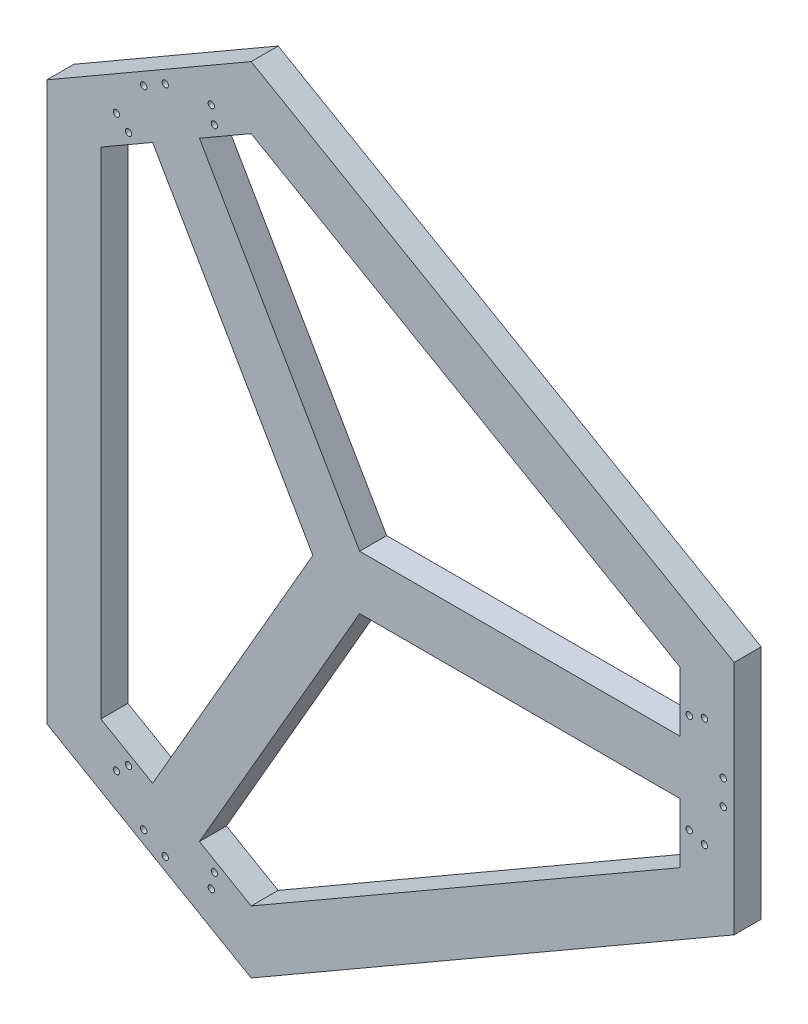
ISO-10303-21;
HEADER;
FILE_DESCRIPTION(('STEP AP214'),'2;1');
FILE_NAME('part.step','',(''),(''),'','','');
FILE_SCHEMA(('AUTOMOTIVE_DESIGN { 1 0 10303 214 1 1 1 1 }'));
ENDSEC;
DATA;
#1=APPLICATION_CONTEXT('core data for automotive mechanical design processes');
#2=APPLICATION_PROTOCOL_DEFINITION('international standard','automotive_design',2000,#1);
#3=PRODUCT_CONTEXT('',#1,'mechanical');
#4=PRODUCT('Part','Part','',(#3));
#5=PRODUCT_RELATED_PRODUCT_CATEGORY('part','',(#4));
#6=PRODUCT_DEFINITION_FORMATION('','',#4);
#7=PRODUCT_DEFINITION_CONTEXT('part definition',#1,'design');
#8=PRODUCT_DEFINITION('design','',#6,#7);
#9=PRODUCT_DEFINITION_SHAPE('','',#8);
#10=(LENGTH_UNIT() NAMED_UNIT(*) SI_UNIT(.MILLI.,.METRE.));
#11=(NAMED_UNIT(*) PLANE_ANGLE_UNIT() SI_UNIT($,.RADIAN.));
#12=(NAMED_UNIT(*) SI_UNIT($,.STERADIAN.) SOLID_ANGLE_UNIT());
#13=UNCERTAINTY_MEASURE_WITH_UNIT(LENGTH_MEASURE(1.E-05),#10,'distance_accuracy_value','');
#14=(GEOMETRIC_REPRESENTATION_CONTEXT(3) GLOBAL_UNCERTAINTY_ASSIGNED_CONTEXT((#13)) GLOBAL_UNIT_ASSIGNED_CONTEXT((#10,
#11,#12)) REPRESENTATION_CONTEXT('',''));
#15=CARTESIAN_POINT('',(0.,0.,0.));
#16=DIRECTION('',(0.,0.,1.));
#17=DIRECTION('',(1.,0.,0.));
#18=AXIS2_PLACEMENT_3D('',#15,#16,#17);
#19=CARTESIAN_POINT('',(-228.670702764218,232.862278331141,25.4));
#20=DIRECTION('',(0.5,-0.866025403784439,0.));
#21=DIRECTION('',(0.866025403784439,0.5,0.));
#22=AXIS2_PLACEMENT_3D('',#19,#20,#21);
#23=PLANE('',#22);
#24=DIRECTION('',(0.,0.,1.));
#25=VECTOR('',#24,1.);
#26=CARTESIAN_POINT('',(-179.997045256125,260.964027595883,0.));
#27=LINE('',#26,#25);
#28=CARTESIAN_POINT('',(-179.997045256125,260.964027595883,0.));
#29=VERTEX_POINT('',#28);
#30=CARTESIAN_POINT('',(-179.997045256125,260.964027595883,25.4));
#31=VERTEX_POINT('',#30);
#32=EDGE_CURVE('E252',#29,#31,#27,.T.);
#33=ORIENTED_EDGE('',*,*,#32,.T.);
#34=DIRECTION('',(-0.866025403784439,-0.5,0.));
#35=VECTOR('',#34,1.);
#36=CARTESIAN_POINT('',(-228.670702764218,232.862278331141,25.4));
#37=LINE('',#36,#35);
#38=CARTESIAN_POINT('',(-228.670702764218,232.862278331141,25.4));
#39=VERTEX_POINT('',#38);
#40=EDGE_CURVE('E366',#31,#39,#37,.T.);
#41=ORIENTED_EDGE('',*,*,#40,.T.);
#42=DIRECTION('',(0.,0.,-1.));
#43=VECTOR('',#42,1.);
#44=CARTESIAN_POINT('',(-228.670702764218,232.862278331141,25.4));
#45=LINE('',#44,#43);
#46=CARTESIAN_POINT('',(-228.670702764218,232.862278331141,0.));
#47=VERTEX_POINT('',#46);
#48=EDGE_CURVE('E405',#39,#47,#45,.T.);
#49=ORIENTED_EDGE('',*,*,#48,.T.);
#50=DIRECTION('',(-0.866025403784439,-0.5,0.));
#51=VECTOR('',#50,1.);
#52=CARTESIAN_POINT('',(-228.670702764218,232.862278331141,0.));
#53=LINE('',#52,#51);
#54=EDGE_CURVE('E62',#29,#47,#53,.T.);
#55=ORIENTED_EDGE('',*,*,#54,.F.);
#56=EDGE_LOOP('',(#33,#41,#49,#55));
#57=FACE_BOUND('',#56,.T.);
#58=ADVANCED_FACE('F39',(#57),#23,.T.);
#59=CARTESIAN_POINT('',(-87.329297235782,-314.465776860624,25.4));
#60=DIRECTION('',(0.5,0.866025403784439,0.));
#61=DIRECTION('',(-0.866025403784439,0.5,0.));
#62=AXIS2_PLACEMENT_3D('',#59,#60,#61);
#63=PLANE('',#62);
#64=DIRECTION('',(0.,0.,1.));
#65=VECTOR('',#64,1.);
#66=CARTESIAN_POINT('',(-136.002954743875,-286.364027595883,0.));
#67=LINE('',#66,#65);
#68=CARTESIAN_POINT('',(-136.002954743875,-286.364027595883,0.));
#69=VERTEX_POINT('',#68);
#70=CARTESIAN_POINT('',(-136.002954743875,-286.364027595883,25.4));
#71=VERTEX_POINT('',#70);
#72=EDGE_CURVE('E244',#69,#71,#67,.T.);
#73=ORIENTED_EDGE('',*,*,#72,.T.);
#74=DIRECTION('',(0.866025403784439,-0.5,0.));
#75=VECTOR('',#74,1.);
#76=CARTESIAN_POINT('',(-87.329297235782,-314.465776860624,25.4));
#77=LINE('',#76,#75);
#78=CARTESIAN_POINT('',(-87.329297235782,-314.465776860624,25.4));
#79=VERTEX_POINT('',#78);
#80=EDGE_CURVE('E371',#71,#79,#77,.T.);
#81=ORIENTED_EDGE('',*,*,#80,.T.);
#82=DIRECTION('',(0.,0.,-1.));
#83=VECTOR('',#82,1.);
#84=CARTESIAN_POINT('',(-87.329297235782,-314.465776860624,25.4));
#85=LINE('',#84,#83);
#86=CARTESIAN_POINT('',(-87.329297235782,-314.465776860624,0.));
#87=VERTEX_POINT('',#86);
#88=EDGE_CURVE('E400',#79,#87,#85,.T.);
#89=ORIENTED_EDGE('',*,*,#88,.T.);
#90=DIRECTION('',(0.866025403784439,-0.5,0.));
#91=VECTOR('',#90,1.);
#92=CARTESIAN_POINT('',(-87.329297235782,-314.465776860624,0.));
#93=LINE('',#92,#91);
#94=EDGE_CURVE('E386',#69,#87,#93,.T.);
#95=ORIENTED_EDGE('',*,*,#94,.F.);
#96=EDGE_LOOP('',(#73,#81,#89,#95));
#97=FACE_BOUND('',#96,.T.);
#98=ADVANCED_FACE('F492',(#97),#63,.T.);
#99=CARTESIAN_POINT('',(316.,81.6034985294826,25.4));
#100=DIRECTION('',(-1.,0.,0.));
#101=DIRECTION('',(0.,0.,1.));
#102=AXIS2_PLACEMENT_3D('',#99,#100,#101);
#103=PLANE('',#102);
#104=DIRECTION('',(0.,0.,1.));
#105=VECTOR('',#104,1.);
#106=CARTESIAN_POINT('',(316.,-25.4,0.));
#107=LINE('',#106,#105);
#108=CARTESIAN_POINT('',(316.,-25.4,0.));
#109=VERTEX_POINT('',#108);
#110=CARTESIAN_POINT('',(316.,-25.4,25.4));
#111=VERTEX_POINT('',#110);
#112=EDGE_CURVE('E238',#109,#111,#107,.T.);
#113=ORIENTED_EDGE('',*,*,#112,.F.);
#114=DIRECTION('',(0.,1.,0.));
#115=VECTOR('',#114,1.);
#116=CARTESIAN_POINT('',(316.,81.6034985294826,0.));
#117=LINE('',#116,#115);
#118=CARTESIAN_POINT('',(316.,-81.6034985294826,0.));
#119=VERTEX_POINT('',#118);
#120=EDGE_CURVE('E367',#119,#109,#117,.T.);
#121=ORIENTED_EDGE('',*,*,#120,.F.);
#122=DIRECTION('',(0.,0.,-1.));
#123=VECTOR('',#122,1.);
#124=CARTESIAN_POINT('',(316.,-81.6034985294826,25.4));
#125=LINE('',#124,#123);
#126=CARTESIAN_POINT('',(316.,-81.6034985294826,25.4));
#127=VERTEX_POINT('',#126);
#128=EDGE_CURVE('E398',#127,#119,#125,.T.);
#129=ORIENTED_EDGE('',*,*,#128,.F.);
#130=DIRECTION('',(0.,1.,0.));
#131=VECTOR('',#130,1.);
#132=CARTESIAN_POINT('',(316.,81.6034985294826,25.4));
#133=LINE('',#132,#131);
#134=EDGE_CURVE('E378',#127,#111,#133,.T.);
#135=ORIENTED_EDGE('',*,*,#134,.T.);
#136=EDGE_LOOP('',(#113,#121,#129,#135));
#137=FACE_BOUND('',#136,.T.);
#138=ADVANCED_FACE('F497',(#137),#103,.T.);
#139=CARTESIAN_POINT('',(0.,0.,25.4));
#140=DIRECTION('',(0.,0.,-1.));
#141=DIRECTION('',(-1.,0.,0.));
#142=AXIS2_PLACEMENT_3D('',#139,#140,#141);
#143=PLANE('',#142);
#144=ORIENTED_EDGE('',*,*,#40,.F.);
#145=DIRECTION('',(0.5,-0.866025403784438,0.));
#146=VECTOR('',#145,1.);
#147=CARTESIAN_POINT('',(-179.997045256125,260.964027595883,25.4));
#148=LINE('',#147,#146);
#149=CARTESIAN_POINT('',(-29.329393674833,0.,25.4));
#150=VERTEX_POINT('',#149);
#151=EDGE_CURVE('E230',#31,#150,#148,.T.);
#152=ORIENTED_EDGE('',*,*,#151,.T.);
#153=DIRECTION('',(-0.5,-0.866025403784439,0.));
#154=VECTOR('',#153,1.);
#155=CARTESIAN_POINT('',(-179.997045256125,-260.964027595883,25.4));
#156=LINE('',#155,#154);
#157=CARTESIAN_POINT('',(-179.997045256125,-260.964027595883,25.4));
#158=VERTEX_POINT('',#157);
#159=EDGE_CURVE('E233',#150,#158,#156,.T.);
#160=ORIENTED_EDGE('',*,*,#159,.T.);
#161=CARTESIAN_POINT('',(-228.670702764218,-232.862278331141,25.4));
#162=VERTEX_POINT('',#161);
#163=EDGE_CURVE('E372',#162,#158,#77,.T.);
#164=ORIENTED_EDGE('',*,*,#163,.F.);
#165=DIRECTION('',(0.,-1.,0.));
#166=VECTOR('',#165,1.);
#167=CARTESIAN_POINT('',(-228.670702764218,232.862278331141,25.4));
#168=LINE('',#167,#166);
#169=EDGE_CURVE('E369',#39,#162,#168,.T.);
#170=ORIENTED_EDGE('',*,*,#169,.F.);
#171=EDGE_LOOP('',(#144,#152,#160,#164,#170));
#172=FACE_BOUND('',#171,.T.);
#173=ORIENTED_EDGE('',*,*,#80,.F.);
#174=DIRECTION('',(0.5,0.866025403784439,0.));
#175=VECTOR('',#174,1.);
#176=CARTESIAN_POINT('',(-136.002954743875,-286.364027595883,25.4));
#177=LINE('',#176,#175);
#178=CARTESIAN_POINT('',(14.6646968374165,-25.4000000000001,25.4));
#179=VERTEX_POINT('',#178);
#180=EDGE_CURVE('E213',#71,#179,#177,.T.);
#181=ORIENTED_EDGE('',*,*,#180,.T.);
#182=DIRECTION('',(1.,0.,0.));
#183=VECTOR('',#182,1.);
#184=CARTESIAN_POINT('',(316.,-25.4,25.4));
#185=LINE('',#184,#183);
#186=EDGE_CURVE('E210',#179,#111,#185,.T.);
#187=ORIENTED_EDGE('',*,*,#186,.T.);
#188=ORIENTED_EDGE('',*,*,#134,.F.);
#189=DIRECTION('',(0.866025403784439,0.5,0.));
#190=VECTOR('',#189,1.);
#191=CARTESIAN_POINT('',(-87.329297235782,-314.465776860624,25.4));
#192=LINE('',#191,#190);
#193=EDGE_CURVE('E374',#79,#127,#192,.T.);
#194=ORIENTED_EDGE('',*,*,#193,.F.);
#195=EDGE_LOOP('',(#173,#181,#187,#188,#194));
#196=FACE_BOUND('',#195,.T.);
#197=DIRECTION('',(-0.866025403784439,-0.5,0.));
#198=VECTOR('',#197,1.);
#199=CARTESIAN_POINT('',(-279.470702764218,262.191672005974,25.4));
#200=LINE('',#199,#198);
#201=CARTESIAN_POINT('',(-87.3292972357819,373.12456421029,25.4));
#202=VERTEX_POINT('',#201);
#203=CARTESIAN_POINT('',(-279.470702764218,262.191672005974,25.4));
#204=VERTEX_POINT('',#203);
#205=EDGE_CURVE('E411',#202,#204,#200,.T.);
#206=ORIENTED_EDGE('',*,*,#205,.T.);
#207=DIRECTION('',(0.,-1.,0.));
#208=VECTOR('',#207,1.);
#209=CARTESIAN_POINT('',(-279.470702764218,262.191672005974,25.4));
#210=LINE('',#209,#208);
#211=CARTESIAN_POINT('',(-279.470702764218,-262.191672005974,25.4));
#212=VERTEX_POINT('',#211);
#213=EDGE_CURVE('E414',#204,#212,#210,.T.);
#214=ORIENTED_EDGE('',*,*,#213,.T.);
#215=DIRECTION('',(0.866025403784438,-0.5,0.));
#216=VECTOR('',#215,1.);
#217=CARTESIAN_POINT('',(-87.329297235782,-373.12456421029,25.4));
#218=LINE('',#217,#216);
#219=CARTESIAN_POINT('',(-87.329297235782,-373.12456421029,25.4));
#220=VERTEX_POINT('',#219);
#221=EDGE_CURVE('E417',#212,#220,#218,.T.);
#222=ORIENTED_EDGE('',*,*,#221,.T.);
#223=DIRECTION('',(0.866025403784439,0.5,0.));
#224=VECTOR('',#223,1.);
#225=CARTESIAN_POINT('',(-87.329297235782,-373.12456421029,25.4));
#226=LINE('',#225,#224);
#227=CARTESIAN_POINT('',(366.8,-110.932892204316,25.4));
#228=VERTEX_POINT('',#227);
#229=EDGE_CURVE('E419',#220,#228,#226,.T.);
#230=ORIENTED_EDGE('',*,*,#229,.T.);
#231=DIRECTION('',(0.,1.,0.));
#232=VECTOR('',#231,1.);
#233=CARTESIAN_POINT('',(366.8,110.932892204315,25.4));
#234=LINE('',#233,#232);
#235=CARTESIAN_POINT('',(366.8,110.932892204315,25.4));
#236=VERTEX_POINT('',#235);
#237=EDGE_CURVE('E421',#228,#236,#234,.T.);
#238=ORIENTED_EDGE('',*,*,#237,.T.);
#239=DIRECTION('',(-0.866025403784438,0.5,0.));
#240=VECTOR('',#239,1.);
#241=CARTESIAN_POINT('',(-87.3292972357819,373.12456421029,25.4));
#242=LINE('',#241,#240);
#243=EDGE_CURVE('E423',#236,#202,#242,.T.);
#244=ORIENTED_EDGE('',*,*,#243,.T.);
#245=EDGE_LOOP('',(#206,#214,#222,#230,#238,#244));
#246=FACE_BOUND('',#245,.T.);
#247=DIRECTION('',(-0.866025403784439,0.5,0.));
#248=VECTOR('',#247,1.);
#249=CARTESIAN_POINT('',(-87.329297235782,314.465776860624,25.4));
#250=LINE('',#249,#248);
#251=CARTESIAN_POINT('',(316.,81.6034985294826,25.4));
#252=VERTEX_POINT('',#251);
#253=CARTESIAN_POINT('',(-87.329297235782,314.465776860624,25.4));
#254=VERTEX_POINT('',#253);
#255=EDGE_CURVE('E364',#252,#254,#250,.T.);
#256=ORIENTED_EDGE('',*,*,#255,.F.);
#257=CARTESIAN_POINT('',(316.,25.4,25.4));
#258=VERTEX_POINT('',#257);
#259=EDGE_CURVE('E377',#258,#252,#133,.T.);
#260=ORIENTED_EDGE('',*,*,#259,.F.);
#261=DIRECTION('',(-1.,0.,0.));
#262=VECTOR('',#261,1.);
#263=CARTESIAN_POINT('',(316.,25.4,25.4));
#264=LINE('',#263,#262);
#265=CARTESIAN_POINT('',(14.6646968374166,25.4,25.4));
#266=VERTEX_POINT('',#265);
#267=EDGE_CURVE('E227',#258,#266,#264,.T.);
#268=ORIENTED_EDGE('',*,*,#267,.T.);
#269=DIRECTION('',(-0.500000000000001,0.866025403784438,0.));
#270=VECTOR('',#269,1.);
#271=CARTESIAN_POINT('',(-136.002954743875,286.364027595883,25.4));
#272=LINE('',#271,#270);
#273=CARTESIAN_POINT('',(-136.002954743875,286.364027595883,25.4));
#274=VERTEX_POINT('',#273);
#275=EDGE_CURVE('E189',#266,#274,#272,.T.);
#276=ORIENTED_EDGE('',*,*,#275,.T.);
#277=EDGE_CURVE('E54',#254,#274,#37,.T.);
#278=ORIENTED_EDGE('',*,*,#277,.F.);
#279=EDGE_LOOP('',(#256,#260,#268,#276,#278));
#280=FACE_BOUND('',#279,.T.);
#281=CARTESIAN_POINT('',(-121.906704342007,-304.371002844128,25.4));
#282=DIRECTION('',(0.,0.,1.));
#283=DIRECTION('',(1.,0.,0.));
#284=AXIS2_PLACEMENT_3D('',#281,#282,#283);
#285=CIRCLE('',#284,3.);
#286=CARTESIAN_POINT('',(-118.906704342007,-304.371002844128,25.4));
#287=VERTEX_POINT('',#286);
#288=EDGE_CURVE('E358',#287,#287,#285,.T.);
#289=ORIENTED_EDGE('',*,*,#288,.F.);
#290=EDGE_LOOP('',(#289));
#291=FACE_BOUND('',#290,.T.);
#292=CARTESIAN_POINT('',(-124.845889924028,-319.202828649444,25.4));
#293=DIRECTION('',(0.,0.,1.));
#294=DIRECTION('',(1.,0.,0.));
#295=AXIS2_PLACEMENT_3D('',#292,#293,#294);
#296=CIRCLE('',#295,2.99999999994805);
#297=CARTESIAN_POINT('',(-121.84588992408,-319.202828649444,25.4));
#298=VERTEX_POINT('',#297);
#299=EDGE_CURVE('E352',#298,#298,#296,.T.);
#300=ORIENTED_EDGE('',*,*,#299,.F.);
#301=EDGE_LOOP('',(#300));
#302=FACE_BOUND('',#301,.T.);
#303=CARTESIAN_POINT('',(-168.16135563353,-314.604883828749,25.4));
#304=DIRECTION('',(0.,0.,1.));
#305=DIRECTION('',(1.,0.,0.));
#306=AXIS2_PLACEMENT_3D('',#303,#304,#305);
#307=CIRCLE('',#306,3.00000000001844);
#308=CARTESIAN_POINT('',(-165.161355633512,-314.604883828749,25.4));
#309=VERTEX_POINT('',#308);
#310=EDGE_CURVE('E346',#309,#309,#307,.T.);
#311=ORIENTED_EDGE('',*,*,#310,.F.);
#312=EDGE_LOOP('',(#311));
#313=FACE_BOUND('',#312,.T.);
#314=CARTESIAN_POINT('',(-188.375143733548,-302.93444782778,25.4));
#315=DIRECTION('',(0.,0.,1.));
#316=DIRECTION('',(1.,0.,0.));
#317=AXIS2_PLACEMENT_3D('',#314,#315,#316);
#318=CIRCLE('',#317,3.00000000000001);
#319=CARTESIAN_POINT('',(-185.375143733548,-302.93444782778,25.4));
#320=VERTEX_POINT('',#319);
#321=EDGE_CURVE('E340',#320,#320,#318,.T.);
#322=ORIENTED_EDGE('',*,*,#321,.F.);
#323=EDGE_LOOP('',(#322));
#324=FACE_BOUND('',#323,.T.);
#325=CARTESIAN_POINT('',(324.546372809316,46.6111985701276,25.4));
#326=DIRECTION('',(0.,0.,1.));
#327=DIRECTION('',(1.,0.,0.));
#328=AXIS2_PLACEMENT_3D('',#325,#326,#327);
#329=CIRCLE('',#328,3.00000000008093);
#330=CARTESIAN_POINT('',(327.546372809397,46.6111985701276,25.4));
#331=VERTEX_POINT('',#330);
#332=EDGE_CURVE('E334',#331,#331,#329,.T.);
#333=ORIENTED_EDGE('',*,*,#332,.F.);
#334=EDGE_LOOP('',(#333));
#335=FACE_BOUND('',#334,.T.);
#336=CARTESIAN_POINT('',(338.860703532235,51.4817020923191,25.4));
#337=DIRECTION('',(0.,0.,1.));
#338=DIRECTION('',(1.,0.,0.));
#339=AXIS2_PLACEMENT_3D('',#336,#337,#338);
#340=CIRCLE('',#339,3.00000000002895);
#341=CARTESIAN_POINT('',(341.860703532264,51.4817020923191,25.4));
#342=VERTEX_POINT('',#341);
#343=EDGE_CURVE('E328',#342,#342,#340,.T.);
#344=ORIENTED_EDGE('',*,*,#343,.F.);
#345=EDGE_LOOP('',(#344));
#346=FACE_BOUND('',#345,.T.);
#347=CARTESIAN_POINT('',(356.536499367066,11.6704360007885,25.4));
#348=DIRECTION('',(0.,0.,1.));
#349=DIRECTION('',(1.,0.,0.));
#350=AXIS2_PLACEMENT_3D('',#347,#348,#349);
#351=CIRCLE('',#350,2.99999999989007);
#352=CARTESIAN_POINT('',(359.536499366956,11.6704360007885,25.4));
#353=VERTEX_POINT('',#352);
#354=EDGE_CURVE('E322',#353,#353,#351,.T.);
#355=ORIENTED_EDGE('',*,*,#354,.F.);
#356=EDGE_LOOP('',(#355));
#357=FACE_BOUND('',#356,.T.);
#358=CARTESIAN_POINT('',(356.536499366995,-11.6704360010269,25.4));
#359=DIRECTION('',(0.,0.,1.));
#360=DIRECTION('',(1.,0.,0.));
#361=AXIS2_PLACEMENT_3D('',#358,#359,#360);
#362=CIRCLE('',#361,2.99999999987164);
#363=CARTESIAN_POINT('',(359.536499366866,-11.6704360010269,25.4));
#364=VERTEX_POINT('',#363);
#365=EDGE_CURVE('E316',#364,#364,#362,.T.);
#366=ORIENTED_EDGE('',*,*,#365,.F.);
#367=EDGE_LOOP('',(#366));
#368=FACE_BOUND('',#367,.T.);
#369=CARTESIAN_POINT('',(324.546372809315,-46.6111985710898,25.4));
#370=DIRECTION('',(0.,0.,1.));
#371=DIRECTION('',(1.,0.,0.));
#372=AXIS2_PLACEMENT_3D('',#369,#370,#371);
#373=CIRCLE('',#372,3.00000000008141);
#374=CARTESIAN_POINT('',(327.546372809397,-46.6111985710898,25.4));
#375=VERTEX_POINT('',#374);
#376=EDGE_CURVE('E310',#375,#375,#373,.T.);
#377=ORIENTED_EDGE('',*,*,#376,.F.);
#378=EDGE_LOOP('',(#377));
#379=FACE_BOUND('',#378,.T.);
#380=CARTESIAN_POINT('',(338.860703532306,-51.4817020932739,25.4));
#381=DIRECTION('',(0.,0.,1.));
#382=DIRECTION('',(1.,0.,0.));
#383=AXIS2_PLACEMENT_3D('',#380,#381,#382);
#384=CIRCLE('',#383,3.00000000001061);
#385=CARTESIAN_POINT('',(341.860703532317,-51.4817020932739,25.4));
#386=VERTEX_POINT('',#385);
#387=EDGE_CURVE('E304',#386,#386,#384,.T.);
#388=ORIENTED_EDGE('',*,*,#387,.F.);
#389=EDGE_LOOP('',(#388));
#390=FACE_BOUND('',#389,.T.);
#391=CARTESIAN_POINT('',(-202.639668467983,-257.759804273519,25.4));
#392=DIRECTION('',(0.,0.,1.));
#393=DIRECTION('',(1.,0.,0.));
#394=AXIS2_PLACEMENT_3D('',#391,#392,#393);
#395=CIRCLE('',#394,3.);
#396=CARTESIAN_POINT('',(-199.639668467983,-257.759804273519,25.4));
#397=VERTEX_POINT('',#396);
#398=EDGE_CURVE('E298',#397,#397,#395,.T.);
#399=ORIENTED_EDGE('',*,*,#398,.F.);
#400=EDGE_LOOP('',(#399));
#401=FACE_BOUND('',#400,.T.);
#402=CARTESIAN_POINT('',(-214.014813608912,-267.721126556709,25.4));
#403=DIRECTION('',(0.,0.,1.));
#404=DIRECTION('',(1.,0.,0.));
#405=AXIS2_PLACEMENT_3D('',#402,#403,#404);
#406=CIRCLE('',#405,2.99999999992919);
#407=CARTESIAN_POINT('',(-211.014813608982,-267.721126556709,25.4));
#408=VERTEX_POINT('',#407);
#409=EDGE_CURVE('E292',#408,#408,#406,.T.);
#410=ORIENTED_EDGE('',*,*,#409,.F.);
#411=EDGE_LOOP('',(#410));
#412=FACE_BOUND('',#411,.T.);
#413=CARTESIAN_POINT('',(-202.639668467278,257.75980427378,25.4));
#414=DIRECTION('',(0.,0.,1.));
#415=DIRECTION('',(1.,0.,0.));
#416=AXIS2_PLACEMENT_3D('',#413,#414,#415);
#417=CIRCLE('',#416,3.00000000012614);
#418=CARTESIAN_POINT('',(-199.639668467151,257.75980427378,25.4));
#419=VERTEX_POINT('',#418);
#420=EDGE_CURVE('E286',#419,#419,#417,.T.);
#421=ORIENTED_EDGE('',*,*,#420,.F.);
#422=EDGE_LOOP('',(#421));
#423=FACE_BOUND('',#422,.T.);
#424=CARTESIAN_POINT('',(-214.014813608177,267.721126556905,25.4));
#425=DIRECTION('',(0.,0.,1.));
#426=DIRECTION('',(1.,0.,0.));
#427=AXIS2_PLACEMENT_3D('',#424,#425,#426);
#428=CIRCLE('',#427,3.00000000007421);
#429=CARTESIAN_POINT('',(-211.014813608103,267.721126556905,25.4));
#430=VERTEX_POINT('',#429);
#431=EDGE_CURVE('E280',#430,#430,#428,.T.);
#432=ORIENTED_EDGE('',*,*,#431,.F.);
#433=EDGE_LOOP('',(#432));
#434=FACE_BOUND('',#433,.T.);
#435=CARTESIAN_POINT('',(-188.375143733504,302.93444782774,25.4));
#436=DIRECTION('',(0.,0.,1.));
#437=DIRECTION('',(1.,0.,0.));
#438=AXIS2_PLACEMENT_3D('',#435,#436,#437);
#439=CIRCLE('',#438,2.99999999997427);
#440=CARTESIAN_POINT('',(-185.37514373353,302.93444782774,25.4));
#441=VERTEX_POINT('',#440);
#442=EDGE_CURVE('E274',#441,#441,#439,.T.);
#443=ORIENTED_EDGE('',*,*,#442,.F.);
#444=EDGE_LOOP('',(#443));
#445=FACE_BOUND('',#444,.T.);
#446=CARTESIAN_POINT('',(-168.161355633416,314.604883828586,25.4));
#447=DIRECTION('',(0.,0.,1.));
#448=DIRECTION('',(1.,0.,0.));
#449=AXIS2_PLACEMENT_3D('',#446,#447,#448);
#450=CIRCLE('',#449,2.99999999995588);
#451=CARTESIAN_POINT('',(-165.16135563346,314.604883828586,25.4));
#452=VERTEX_POINT('',#451);
#453=EDGE_CURVE('E268',#452,#452,#450,.T.);
#454=ORIENTED_EDGE('',*,*,#453,.F.);
#455=EDGE_LOOP('',(#454));
#456=FACE_BOUND('',#455,.T.);
#457=CARTESIAN_POINT('',(-121.906704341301,304.371002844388,25.4));
#458=DIRECTION('',(0.,0.,1.));
#459=DIRECTION('',(1.,0.,0.));
#460=AXIS2_PLACEMENT_3D('',#457,#458,#459);
#461=CIRCLE('',#460,3.00000000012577);
#462=CARTESIAN_POINT('',(-118.906704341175,304.371002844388,25.4));
#463=VERTEX_POINT('',#462);
#464=EDGE_CURVE('E262',#463,#463,#461,.T.);
#465=ORIENTED_EDGE('',*,*,#464,.F.);
#466=EDGE_LOOP('',(#465));
#467=FACE_BOUND('',#466,.T.);
#468=CARTESIAN_POINT('',(-124.845889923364,319.202828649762,25.4));
#469=DIRECTION('',(0.,0.,1.));
#470=DIRECTION('',(1.,0.,0.));
#471=AXIS2_PLACEMENT_3D('',#468,#469,#470);
#472=CIRCLE('',#471,3.00000000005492);
#473=CARTESIAN_POINT('',(-121.845889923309,319.202828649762,25.4));
#474=VERTEX_POINT('',#473);
#475=EDGE_CURVE('E256',#474,#474,#472,.T.);
#476=ORIENTED_EDGE('',*,*,#475,.F.);
#477=EDGE_LOOP('',(#476));
#478=FACE_BOUND('',#477,.T.);
#479=ADVANCED_FACE('F470',(#172,#196,#246,#280,#291,#302,#313,#324,#335,#346,#357,#368,#379,
#390,#401,#412,#423,#434,#445,#456,#467,#478),#143,.F.);
#480=CARTESIAN_POINT('',(0.,0.,0.));
#481=DIRECTION('',(0.,0.,-1.));
#482=DIRECTION('',(-1.,0.,0.));
#483=AXIS2_PLACEMENT_3D('',#480,#481,#482);
#484=PLANE('',#483);
#485=DIRECTION('',(0.5,-0.866025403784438,0.));
#486=VECTOR('',#485,1.);
#487=CARTESIAN_POINT('',(-179.997045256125,260.964027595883,0.));
#488=LINE('',#487,#486);
#489=CARTESIAN_POINT('',(-29.329393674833,0.,0.));
#490=VERTEX_POINT('',#489);
#491=EDGE_CURVE('E205',#29,#490,#488,.T.);
#492=ORIENTED_EDGE('',*,*,#491,.F.);
#493=ORIENTED_EDGE('',*,*,#54,.T.);
#494=DIRECTION('',(0.,-1.,0.));
#495=VECTOR('',#494,1.);
#496=CARTESIAN_POINT('',(-228.670702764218,232.862278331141,0.));
#497=LINE('',#496,#495);
#498=CARTESIAN_POINT('',(-228.670702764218,-232.862278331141,0.));
#499=VERTEX_POINT('',#498);
#500=EDGE_CURVE('E383',#47,#499,#497,.T.);
#501=ORIENTED_EDGE('',*,*,#500,.T.);
#502=CARTESIAN_POINT('',(-179.997045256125,-260.964027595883,0.));
#503=VERTEX_POINT('',#502);
#504=EDGE_CURVE('E387',#499,#503,#93,.T.);
#505=ORIENTED_EDGE('',*,*,#504,.T.);
#506=DIRECTION('',(-0.5,-0.866025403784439,0.));
#507=VECTOR('',#506,1.);
#508=CARTESIAN_POINT('',(-179.997045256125,-260.964027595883,0.));
#509=LINE('',#508,#507);
#510=EDGE_CURVE('E218',#490,#503,#509,.T.);
#511=ORIENTED_EDGE('',*,*,#510,.F.);
#512=EDGE_LOOP('',(#492,#493,#501,#505,#511));
#513=FACE_BOUND('',#512,.T.);
#514=DIRECTION('',(0.5,0.866025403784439,0.));
#515=VECTOR('',#514,1.);
#516=CARTESIAN_POINT('',(-136.002954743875,-286.364027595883,0.));
#517=LINE('',#516,#515);
#518=CARTESIAN_POINT('',(14.6646968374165,-25.4000000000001,0.));
#519=VERTEX_POINT('',#518);
#520=EDGE_CURVE('E221',#69,#519,#517,.T.);
#521=ORIENTED_EDGE('',*,*,#520,.F.);
#522=ORIENTED_EDGE('',*,*,#94,.T.);
#523=DIRECTION('',(0.866025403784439,0.5,0.));
#524=VECTOR('',#523,1.);
#525=CARTESIAN_POINT('',(-87.329297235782,-314.465776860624,0.));
#526=LINE('',#525,#524);
#527=EDGE_CURVE('E390',#87,#119,#526,.T.);
#528=ORIENTED_EDGE('',*,*,#527,.T.);
#529=ORIENTED_EDGE('',*,*,#120,.T.);
#530=DIRECTION('',(1.,0.,0.));
#531=VECTOR('',#530,1.);
#532=CARTESIAN_POINT('',(316.,-25.4,0.));
#533=LINE('',#532,#531);
#534=EDGE_CURVE('E224',#519,#109,#533,.T.);
#535=ORIENTED_EDGE('',*,*,#534,.F.);
#536=EDGE_LOOP('',(#521,#522,#528,#529,#535));
#537=FACE_BOUND('',#536,.T.);
#538=CARTESIAN_POINT('',(-121.906704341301,304.371002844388,0.));
#539=DIRECTION('',(0.,0.,1.));
#540=DIRECTION('',(1.,0.,0.));
#541=AXIS2_PLACEMENT_3D('',#538,#539,#540);
#542=CIRCLE('',#541,3.00000000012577);
#543=CARTESIAN_POINT('',(-118.906704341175,304.371002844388,0.));
#544=VERTEX_POINT('',#543);
#545=EDGE_CURVE('E259',#544,#544,#542,.T.);
#546=ORIENTED_EDGE('',*,*,#545,.T.);
#547=EDGE_LOOP('',(#546));
#548=FACE_BOUND('',#547,.T.);
#549=CARTESIAN_POINT('',(-188.375143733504,302.93444782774,0.));
#550=DIRECTION('',(0.,0.,1.));
#551=DIRECTION('',(1.,0.,0.));
#552=AXIS2_PLACEMENT_3D('',#549,#550,#551);
#553=CIRCLE('',#552,2.99999999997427);
#554=CARTESIAN_POINT('',(-185.37514373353,302.93444782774,0.));
#555=VERTEX_POINT('',#554);
#556=EDGE_CURVE('E271',#555,#555,#553,.T.);
#557=ORIENTED_EDGE('',*,*,#556,.T.);
#558=EDGE_LOOP('',(#557));
#559=FACE_BOUND('',#558,.T.);
#560=CARTESIAN_POINT('',(-202.639668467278,257.75980427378,0.));
#561=DIRECTION('',(0.,0.,1.));
#562=DIRECTION('',(1.,0.,0.));
#563=AXIS2_PLACEMENT_3D('',#560,#561,#562);
#564=CIRCLE('',#563,3.00000000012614);
#565=CARTESIAN_POINT('',(-199.639668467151,257.75980427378,0.));
#566=VERTEX_POINT('',#565);
#567=EDGE_CURVE('E283',#566,#566,#564,.T.);
#568=ORIENTED_EDGE('',*,*,#567,.T.);
#569=EDGE_LOOP('',(#568));
#570=FACE_BOUND('',#569,.T.);
#571=CARTESIAN_POINT('',(-202.639668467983,-257.759804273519,0.));
#572=DIRECTION('',(0.,0.,1.));
#573=DIRECTION('',(1.,0.,0.));
#574=AXIS2_PLACEMENT_3D('',#571,#572,#573);
#575=CIRCLE('',#574,3.);
#576=CARTESIAN_POINT('',(-199.639668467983,-257.759804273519,0.));
#577=VERTEX_POINT('',#576);
#578=EDGE_CURVE('E295',#577,#577,#575,.T.);
#579=ORIENTED_EDGE('',*,*,#578,.T.);
#580=EDGE_LOOP('',(#579));
#581=FACE_BOUND('',#580,.T.);
#582=CARTESIAN_POINT('',(324.546372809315,-46.6111985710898,0.));
#583=DIRECTION('',(0.,0.,1.));
#584=DIRECTION('',(1.,0.,0.));
#585=AXIS2_PLACEMENT_3D('',#582,#583,#584);
#586=CIRCLE('',#585,3.00000000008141);
#587=CARTESIAN_POINT('',(327.546372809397,-46.6111985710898,0.));
#588=VERTEX_POINT('',#587);
#589=EDGE_CURVE('E307',#588,#588,#586,.T.);
#590=ORIENTED_EDGE('',*,*,#589,.T.);
#591=EDGE_LOOP('',(#590));
#592=FACE_BOUND('',#591,.T.);
#593=CARTESIAN_POINT('',(356.536499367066,11.6704360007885,0.));
#594=DIRECTION('',(0.,0.,1.));
#595=DIRECTION('',(1.,0.,0.));
#596=AXIS2_PLACEMENT_3D('',#593,#594,#595);
#597=CIRCLE('',#596,2.99999999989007);
#598=CARTESIAN_POINT('',(359.536499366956,11.6704360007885,0.));
#599=VERTEX_POINT('',#598);
#600=EDGE_CURVE('E319',#599,#599,#597,.T.);
#601=ORIENTED_EDGE('',*,*,#600,.T.);
#602=EDGE_LOOP('',(#601));
#603=FACE_BOUND('',#602,.T.);
#604=CARTESIAN_POINT('',(324.546372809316,46.6111985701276,0.));
#605=DIRECTION('',(0.,0.,1.));
#606=DIRECTION('',(1.,0.,0.));
#607=AXIS2_PLACEMENT_3D('',#604,#605,#606);
#608=CIRCLE('',#607,3.00000000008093);
#609=CARTESIAN_POINT('',(327.546372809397,46.6111985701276,0.));
#610=VERTEX_POINT('',#609);
#611=EDGE_CURVE('E331',#610,#610,#608,.T.);
#612=ORIENTED_EDGE('',*,*,#611,.T.);
#613=EDGE_LOOP('',(#612));
#614=FACE_BOUND('',#613,.T.);
#615=CARTESIAN_POINT('',(-168.16135563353,-314.604883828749,0.));
#616=DIRECTION('',(0.,0.,1.));
#617=DIRECTION('',(1.,0.,0.));
#618=AXIS2_PLACEMENT_3D('',#615,#616,#617);
#619=CIRCLE('',#618,3.00000000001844);
#620=CARTESIAN_POINT('',(-165.161355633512,-314.604883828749,0.));
#621=VERTEX_POINT('',#620);
#622=EDGE_CURVE('E343',#621,#621,#619,.T.);
#623=ORIENTED_EDGE('',*,*,#622,.T.);
#624=EDGE_LOOP('',(#623));
#625=FACE_BOUND('',#624,.T.);
#626=CARTESIAN_POINT('',(-121.906704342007,-304.371002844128,0.));
#627=DIRECTION('',(0.,0.,1.));
#628=DIRECTION('',(1.,0.,0.));
#629=AXIS2_PLACEMENT_3D('',#626,#627,#628);
#630=CIRCLE('',#629,3.);
#631=CARTESIAN_POINT('',(-118.906704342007,-304.371002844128,0.));
#632=VERTEX_POINT('',#631);
#633=EDGE_CURVE('E355',#632,#632,#630,.T.);
#634=ORIENTED_EDGE('',*,*,#633,.T.);
#635=EDGE_LOOP('',(#634));
#636=FACE_BOUND('',#635,.T.);
#637=DIRECTION('',(-0.866025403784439,-0.5,0.));
#638=VECTOR('',#637,1.);
#639=CARTESIAN_POINT('',(-279.470702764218,262.191672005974,0.));
#640=LINE('',#639,#638);
#641=CARTESIAN_POINT('',(-87.3292972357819,373.12456421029,0.));
#642=VERTEX_POINT('',#641);
#643=CARTESIAN_POINT('',(-279.470702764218,262.191672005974,0.));
#644=VERTEX_POINT('',#643);
#645=EDGE_CURVE('E410',#642,#644,#640,.T.);
#646=ORIENTED_EDGE('',*,*,#645,.F.);
#647=DIRECTION('',(-0.866025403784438,0.5,0.));
#648=VECTOR('',#647,1.);
#649=CARTESIAN_POINT('',(-87.3292972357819,373.12456421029,0.));
#650=LINE('',#649,#648);
#651=CARTESIAN_POINT('',(366.8,110.932892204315,0.));
#652=VERTEX_POINT('',#651);
#653=EDGE_CURVE('E415',#652,#642,#650,.T.);
#654=ORIENTED_EDGE('',*,*,#653,.F.);
#655=DIRECTION('',(0.,1.,0.));
#656=VECTOR('',#655,1.);
#657=CARTESIAN_POINT('',(366.8,110.932892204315,0.));
#658=LINE('',#657,#656);
#659=CARTESIAN_POINT('',(366.8,-110.932892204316,0.));
#660=VERTEX_POINT('',#659);
#661=EDGE_CURVE('E434',#660,#652,#658,.T.);
#662=ORIENTED_EDGE('',*,*,#661,.F.);
#663=DIRECTION('',(0.866025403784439,0.5,0.));
#664=VECTOR('',#663,1.);
#665=CARTESIAN_POINT('',(-87.329297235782,-373.12456421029,0.));
#666=LINE('',#665,#664);
#667=CARTESIAN_POINT('',(-87.329297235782,-373.12456421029,0.));
#668=VERTEX_POINT('',#667);
#669=EDGE_CURVE('E432',#668,#660,#666,.T.);
#670=ORIENTED_EDGE('',*,*,#669,.F.);
#671=DIRECTION('',(0.866025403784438,-0.5,0.));
#672=VECTOR('',#671,1.);
#673=CARTESIAN_POINT('',(-87.329297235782,-373.12456421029,0.));
#674=LINE('',#673,#672);
#675=CARTESIAN_POINT('',(-279.470702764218,-262.191672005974,0.));
#676=VERTEX_POINT('',#675);
#677=EDGE_CURVE('E430',#676,#668,#674,.T.);
#678=ORIENTED_EDGE('',*,*,#677,.F.);
#679=DIRECTION('',(0.,-1.,0.));
#680=VECTOR('',#679,1.);
#681=CARTESIAN_POINT('',(-279.470702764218,262.191672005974,0.));
#682=LINE('',#681,#680);
#683=EDGE_CURVE('E428',#644,#676,#682,.T.);
#684=ORIENTED_EDGE('',*,*,#683,.F.);
#685=EDGE_LOOP('',(#646,#654,#662,#670,#678,#684));
#686=FACE_BOUND('',#685,.T.);
#687=CARTESIAN_POINT('',(-87.329297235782,314.465776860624,0.));
#688=VERTEX_POINT('',#687);
#689=CARTESIAN_POINT('',(-136.002954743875,286.364027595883,0.));
#690=VERTEX_POINT('',#689);
#691=EDGE_CURVE('E204',#688,#690,#53,.T.);
#692=ORIENTED_EDGE('',*,*,#691,.T.);
#693=DIRECTION('',(-0.500000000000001,0.866025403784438,0.));
#694=VECTOR('',#693,1.);
#695=CARTESIAN_POINT('',(-136.002954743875,286.364027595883,0.));
#696=LINE('',#695,#694);
#697=CARTESIAN_POINT('',(14.6646968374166,25.4,0.));
#698=VERTEX_POINT('',#697);
#699=EDGE_CURVE('E187',#698,#690,#696,.T.);
#700=ORIENTED_EDGE('',*,*,#699,.F.);
#701=DIRECTION('',(-1.,0.,0.));
#702=VECTOR('',#701,1.);
#703=CARTESIAN_POINT('',(316.,25.4,0.));
#704=LINE('',#703,#702);
#705=CARTESIAN_POINT('',(316.,25.4,0.));
#706=VERTEX_POINT('',#705);
#707=EDGE_CURVE('E202',#706,#698,#704,.T.);
#708=ORIENTED_EDGE('',*,*,#707,.F.);
#709=CARTESIAN_POINT('',(316.,81.6034985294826,0.));
#710=VERTEX_POINT('',#709);
#711=EDGE_CURVE('E393',#706,#710,#117,.T.);
#712=ORIENTED_EDGE('',*,*,#711,.T.);
#713=DIRECTION('',(-0.866025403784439,0.5,0.));
#714=VECTOR('',#713,1.);
#715=CARTESIAN_POINT('',(-87.329297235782,314.465776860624,0.));
#716=LINE('',#715,#714);
#717=EDGE_CURVE('E361',#710,#688,#716,.T.);
#718=ORIENTED_EDGE('',*,*,#717,.T.);
#719=EDGE_LOOP('',(#692,#700,#708,#712,#718));
#720=FACE_BOUND('',#719,.T.);
#721=CARTESIAN_POINT('',(-124.845889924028,-319.202828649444,0.));
#722=DIRECTION('',(0.,0.,1.));
#723=DIRECTION('',(1.,0.,0.));
#724=AXIS2_PLACEMENT_3D('',#721,#722,#723);
#725=CIRCLE('',#724,2.99999999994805);
#726=CARTESIAN_POINT('',(-121.84588992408,-319.202828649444,0.));
#727=VERTEX_POINT('',#726);
#728=EDGE_CURVE('E349',#727,#727,#725,.T.);
#729=ORIENTED_EDGE('',*,*,#728,.T.);
#730=EDGE_LOOP('',(#729));
#731=FACE_BOUND('',#730,.T.);
#732=CARTESIAN_POINT('',(-188.375143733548,-302.93444782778,0.));
#733=DIRECTION('',(0.,0.,1.));
#734=DIRECTION('',(1.,0.,0.));
#735=AXIS2_PLACEMENT_3D('',#732,#733,#734);
#736=CIRCLE('',#735,3.00000000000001);
#737=CARTESIAN_POINT('',(-185.375143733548,-302.93444782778,0.));
#738=VERTEX_POINT('',#737);
#739=EDGE_CURVE('E337',#738,#738,#736,.T.);
#740=ORIENTED_EDGE('',*,*,#739,.T.);
#741=EDGE_LOOP('',(#740));
#742=FACE_BOUND('',#741,.T.);
#743=CARTESIAN_POINT('',(338.860703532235,51.4817020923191,0.));
#744=DIRECTION('',(0.,0.,1.));
#745=DIRECTION('',(1.,0.,0.));
#746=AXIS2_PLACEMENT_3D('',#743,#744,#745);
#747=CIRCLE('',#746,3.00000000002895);
#748=CARTESIAN_POINT('',(341.860703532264,51.4817020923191,0.));
#749=VERTEX_POINT('',#748);
#750=EDGE_CURVE('E325',#749,#749,#747,.T.);
#751=ORIENTED_EDGE('',*,*,#750,.T.);
#752=EDGE_LOOP('',(#751));
#753=FACE_BOUND('',#752,.T.);
#754=CARTESIAN_POINT('',(356.536499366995,-11.6704360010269,0.));
#755=DIRECTION('',(0.,0.,1.));
#756=DIRECTION('',(1.,0.,0.));
#757=AXIS2_PLACEMENT_3D('',#754,#755,#756);
#758=CIRCLE('',#757,2.99999999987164);
#759=CARTESIAN_POINT('',(359.536499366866,-11.6704360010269,0.));
#760=VERTEX_POINT('',#759);
#761=EDGE_CURVE('E313',#760,#760,#758,.T.);
#762=ORIENTED_EDGE('',*,*,#761,.T.);
#763=EDGE_LOOP('',(#762));
#764=FACE_BOUND('',#763,.T.);
#765=CARTESIAN_POINT('',(338.860703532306,-51.4817020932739,0.));
#766=DIRECTION('',(0.,0.,1.));
#767=DIRECTION('',(1.,0.,0.));
#768=AXIS2_PLACEMENT_3D('',#765,#766,#767);
#769=CIRCLE('',#768,3.00000000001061);
#770=CARTESIAN_POINT('',(341.860703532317,-51.4817020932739,0.));
#771=VERTEX_POINT('',#770);
#772=EDGE_CURVE('E301',#771,#771,#769,.T.);
#773=ORIENTED_EDGE('',*,*,#772,.T.);
#774=EDGE_LOOP('',(#773));
#775=FACE_BOUND('',#774,.T.);
#776=CARTESIAN_POINT('',(-214.014813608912,-267.721126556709,0.));
#777=DIRECTION('',(0.,0.,1.));
#778=DIRECTION('',(1.,0.,0.));
#779=AXIS2_PLACEMENT_3D('',#776,#777,#778);
#780=CIRCLE('',#779,2.99999999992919);
#781=CARTESIAN_POINT('',(-211.014813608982,-267.721126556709,0.));
#782=VERTEX_POINT('',#781);
#783=EDGE_CURVE('E289',#782,#782,#780,.T.);
#784=ORIENTED_EDGE('',*,*,#783,.T.);
#785=EDGE_LOOP('',(#784));
#786=FACE_BOUND('',#785,.T.);
#787=CARTESIAN_POINT('',(-214.014813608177,267.721126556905,0.));
#788=DIRECTION('',(0.,0.,1.));
#789=DIRECTION('',(1.,0.,0.));
#790=AXIS2_PLACEMENT_3D('',#787,#788,#789);
#791=CIRCLE('',#790,3.00000000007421);
#792=CARTESIAN_POINT('',(-211.014813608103,267.721126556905,0.));
#793=VERTEX_POINT('',#792);
#794=EDGE_CURVE('E277',#793,#793,#791,.T.);
#795=ORIENTED_EDGE('',*,*,#794,.T.);
#796=EDGE_LOOP('',(#795));
#797=FACE_BOUND('',#796,.T.);
#798=CARTESIAN_POINT('',(-168.161355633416,314.604883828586,0.));
#799=DIRECTION('',(0.,0.,1.));
#800=DIRECTION('',(1.,0.,0.));
#801=AXIS2_PLACEMENT_3D('',#798,#799,#800);
#802=CIRCLE('',#801,2.99999999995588);
#803=CARTESIAN_POINT('',(-165.16135563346,314.604883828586,0.));
#804=VERTEX_POINT('',#803);
#805=EDGE_CURVE('E265',#804,#804,#802,.T.);
#806=ORIENTED_EDGE('',*,*,#805,.T.);
#807=EDGE_LOOP('',(#806));
#808=FACE_BOUND('',#807,.T.);
#809=CARTESIAN_POINT('',(-124.845889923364,319.202828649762,0.));
#810=DIRECTION('',(0.,0.,1.));
#811=DIRECTION('',(1.,0.,0.));
#812=AXIS2_PLACEMENT_3D('',#809,#810,#811);
#813=CIRCLE('',#812,3.00000000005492);
#814=CARTESIAN_POINT('',(-121.845889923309,319.202828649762,0.));
#815=VERTEX_POINT('',#814);
#816=EDGE_CURVE('E241',#815,#815,#813,.T.);
#817=ORIENTED_EDGE('',*,*,#816,.T.);
#818=EDGE_LOOP('',(#817));
#819=FACE_BOUND('',#818,.T.);
#820=ADVANCED_FACE('F200',(#513,#537,#548,#559,#570,#581,#592,#603,#614,#625,#636,#686,#720,
#731,#742,#753,#764,#775,#786,#797,#808,#819),#484,.T.);
#821=CARTESIAN_POINT('',(-279.470702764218,262.191672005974,25.4));
#822=DIRECTION('',(0.5,-0.866025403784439,0.));
#823=DIRECTION('',(0.866025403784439,0.5,0.));
#824=AXIS2_PLACEMENT_3D('',#821,#822,#823);
#825=PLANE('',#824);
#826=ORIENTED_EDGE('',*,*,#645,.T.);
#827=DIRECTION('',(0.,0.,-1.));
#828=VECTOR('',#827,1.);
#829=CARTESIAN_POINT('',(-279.470702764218,262.191672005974,25.4));
#830=LINE('',#829,#828);
#831=EDGE_CURVE('E11',#204,#644,#830,.T.);
#832=ORIENTED_EDGE('',*,*,#831,.F.);
#833=ORIENTED_EDGE('',*,*,#205,.F.);
#834=DIRECTION('',(0.,0.,-1.));
#835=VECTOR('',#834,1.);
#836=CARTESIAN_POINT('',(-87.3292972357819,373.12456421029,25.4));
#837=LINE('',#836,#835);
#838=EDGE_CURVE('E425',#202,#642,#837,.T.);
#839=ORIENTED_EDGE('',*,*,#838,.T.);
#840=EDGE_LOOP('',(#826,#832,#833,#839));
#841=FACE_BOUND('',#840,.T.);
#842=ADVANCED_FACE('F41',(#841),#825,.F.);
#843=CARTESIAN_POINT('',(-279.470702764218,262.191672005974,25.4));
#844=DIRECTION('',(1.,0.,0.));
#845=DIRECTION('',(0.,1.,0.));
#846=AXIS2_PLACEMENT_3D('',#843,#844,#845);
#847=PLANE('',#846);
#848=ORIENTED_EDGE('',*,*,#683,.T.);
#849=DIRECTION('',(0.,0.,-1.));
#850=VECTOR('',#849,1.);
#851=CARTESIAN_POINT('',(-279.470702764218,-262.191672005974,25.4));
#852=LINE('',#851,#850);
#853=EDGE_CURVE('E47',#212,#676,#852,.T.);
#854=ORIENTED_EDGE('',*,*,#853,.F.);
#855=ORIENTED_EDGE('',*,*,#213,.F.);
#856=ORIENTED_EDGE('',*,*,#831,.T.);
#857=EDGE_LOOP('',(#848,#854,#855,#856));
#858=FACE_BOUND('',#857,.T.);
#859=ADVANCED_FACE('F475',(#858),#847,.F.);
#860=CARTESIAN_POINT('',(-87.329297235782,-373.12456421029,25.4));
#861=DIRECTION('',(0.5,0.866025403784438,0.));
#862=DIRECTION('',(-0.866025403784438,0.5,0.));
#863=AXIS2_PLACEMENT_3D('',#860,#861,#862);
#864=PLANE('',#863);
#865=ORIENTED_EDGE('',*,*,#677,.T.);
#866=DIRECTION('',(0.,0.,-1.));
#867=VECTOR('',#866,1.);
#868=CARTESIAN_POINT('',(-87.329297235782,-373.12456421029,25.4));
#869=LINE('',#868,#867);
#870=EDGE_CURVE('E445',#220,#668,#869,.T.);
#871=ORIENTED_EDGE('',*,*,#870,.F.);
#872=ORIENTED_EDGE('',*,*,#221,.F.);
#873=ORIENTED_EDGE('',*,*,#853,.T.);
#874=EDGE_LOOP('',(#865,#871,#872,#873));
#875=FACE_BOUND('',#874,.T.);
#876=ADVANCED_FACE('F452',(#875),#864,.F.);
#877=CARTESIAN_POINT('',(-87.329297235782,-373.12456421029,25.4));
#878=DIRECTION('',(-0.5,0.866025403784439,0.));
#879=DIRECTION('',(-0.866025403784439,-0.5,0.));
#880=AXIS2_PLACEMENT_3D('',#877,#878,#879);
#881=PLANE('',#880);
#882=ORIENTED_EDGE('',*,*,#669,.T.);
#883=DIRECTION('',(0.,0.,-1.));
#884=VECTOR('',#883,1.);
#885=CARTESIAN_POINT('',(366.8,-110.932892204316,25.4));
#886=LINE('',#885,#884);
#887=EDGE_CURVE('E442',#228,#660,#886,.T.);
#888=ORIENTED_EDGE('',*,*,#887,.F.);
#889=ORIENTED_EDGE('',*,*,#229,.F.);
#890=ORIENTED_EDGE('',*,*,#870,.T.);
#891=EDGE_LOOP('',(#882,#888,#889,#890));
#892=FACE_BOUND('',#891,.T.);
#893=ADVANCED_FACE('F462',(#892),#881,.F.);
#894=CARTESIAN_POINT('',(366.8,110.932892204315,25.4));
#895=DIRECTION('',(-1.,0.,0.));
#896=DIRECTION('',(0.,0.,1.));
#897=AXIS2_PLACEMENT_3D('',#894,#895,#896);
#898=PLANE('',#897);
#899=ORIENTED_EDGE('',*,*,#661,.T.);
#900=DIRECTION('',(0.,0.,-1.));
#901=VECTOR('',#900,1.);
#902=CARTESIAN_POINT('',(366.8,110.932892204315,25.4));
#903=LINE('',#902,#901);
#904=EDGE_CURVE('E439',#236,#652,#903,.T.);
#905=ORIENTED_EDGE('',*,*,#904,.F.);
#906=ORIENTED_EDGE('',*,*,#237,.F.);
#907=ORIENTED_EDGE('',*,*,#887,.T.);
#908=EDGE_LOOP('',(#899,#905,#906,#907));
#909=FACE_BOUND('',#908,.T.);
#910=ADVANCED_FACE('F466',(#909),#898,.F.);
#911=CARTESIAN_POINT('',(-87.3292972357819,373.12456421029,25.4));
#912=DIRECTION('',(-0.5,-0.866025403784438,0.));
#913=DIRECTION('',(0.866025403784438,-0.5,0.));
#914=AXIS2_PLACEMENT_3D('',#911,#912,#913);
#915=PLANE('',#914);
#916=ORIENTED_EDGE('',*,*,#653,.T.);
#917=ORIENTED_EDGE('',*,*,#838,.F.);
#918=ORIENTED_EDGE('',*,*,#243,.F.);
#919=ORIENTED_EDGE('',*,*,#904,.T.);
#920=EDGE_LOOP('',(#916,#917,#918,#919));
#921=FACE_BOUND('',#920,.T.);
#922=ADVANCED_FACE('F478',(#921),#915,.F.);
#923=CARTESIAN_POINT('',(-87.329297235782,314.465776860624,25.4));
#924=DIRECTION('',(-0.5,-0.866025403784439,0.));
#925=DIRECTION('',(0.866025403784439,-0.5,0.));
#926=AXIS2_PLACEMENT_3D('',#923,#924,#925);
#927=PLANE('',#926);
#928=ORIENTED_EDGE('',*,*,#717,.F.);
#929=DIRECTION('',(0.,0.,-1.));
#930=VECTOR('',#929,1.);
#931=CARTESIAN_POINT('',(316.,81.6034985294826,25.4));
#932=LINE('',#931,#930);
#933=EDGE_CURVE('E380',#252,#710,#932,.T.);
#934=ORIENTED_EDGE('',*,*,#933,.F.);
#935=ORIENTED_EDGE('',*,*,#255,.T.);
#936=DIRECTION('',(0.,0.,-1.));
#937=VECTOR('',#936,1.);
#938=CARTESIAN_POINT('',(-87.329297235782,314.465776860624,25.4));
#939=LINE('',#938,#937);
#940=EDGE_CURVE('E407',#254,#688,#939,.T.);
#941=ORIENTED_EDGE('',*,*,#940,.T.);
#942=EDGE_LOOP('',(#928,#934,#935,#941));
#943=FACE_BOUND('',#942,.T.);
#944=ADVANCED_FACE('F480',(#943),#927,.T.);
#945=DIRECTION('',(0.,0.,1.));
#946=VECTOR('',#945,1.);
#947=CARTESIAN_POINT('',(-136.002954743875,286.364027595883,0.));
#948=LINE('',#947,#946);
#949=EDGE_CURVE('E194',#690,#274,#948,.T.);
#950=ORIENTED_EDGE('',*,*,#949,.F.);
#951=ORIENTED_EDGE('',*,*,#691,.F.);
#952=ORIENTED_EDGE('',*,*,#940,.F.);
#953=ORIENTED_EDGE('',*,*,#277,.T.);
#954=EDGE_LOOP('',(#950,#951,#952,#953));
#955=FACE_BOUND('',#954,.T.);
#956=ADVANCED_FACE('F486',(#955),#23,.T.);
#957=CARTESIAN_POINT('',(-228.670702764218,232.862278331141,25.4));
#958=DIRECTION('',(1.,0.,0.));
#959=DIRECTION('',(0.,1.,0.));
#960=AXIS2_PLACEMENT_3D('',#957,#958,#959);
#961=PLANE('',#960);
#962=ORIENTED_EDGE('',*,*,#500,.F.);
#963=ORIENTED_EDGE('',*,*,#48,.F.);
#964=ORIENTED_EDGE('',*,*,#169,.T.);
#965=DIRECTION('',(0.,0.,-1.));
#966=VECTOR('',#965,1.);
#967=CARTESIAN_POINT('',(-228.670702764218,-232.862278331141,25.4));
#968=LINE('',#967,#966);
#969=EDGE_CURVE('E403',#162,#499,#968,.T.);
#970=ORIENTED_EDGE('',*,*,#969,.T.);
#971=EDGE_LOOP('',(#962,#963,#964,#970));
#972=FACE_BOUND('',#971,.T.);
#973=ADVANCED_FACE('F503',(#972),#961,.T.);
#974=DIRECTION('',(0.,0.,1.));
#975=VECTOR('',#974,1.);
#976=CARTESIAN_POINT('',(-179.997045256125,-260.964027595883,0.));
#977=LINE('',#976,#975);
#978=EDGE_CURVE('E247',#503,#158,#977,.T.);
#979=ORIENTED_EDGE('',*,*,#978,.F.);
#980=ORIENTED_EDGE('',*,*,#504,.F.);
#981=ORIENTED_EDGE('',*,*,#969,.F.);
#982=ORIENTED_EDGE('',*,*,#163,.T.);
#983=EDGE_LOOP('',(#979,#980,#981,#982));
#984=FACE_BOUND('',#983,.T.);
#985=ADVANCED_FACE('F500',(#984),#63,.T.);
#986=CARTESIAN_POINT('',(-87.329297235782,-314.465776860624,25.4));
#987=DIRECTION('',(-0.5,0.866025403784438,0.));
#988=DIRECTION('',(-0.866025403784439,-0.5,0.));
#989=AXIS2_PLACEMENT_3D('',#986,#987,#988);
#990=PLANE('',#989);
#991=ORIENTED_EDGE('',*,*,#527,.F.);
#992=ORIENTED_EDGE('',*,*,#88,.F.);
#993=ORIENTED_EDGE('',*,*,#193,.T.);
#994=ORIENTED_EDGE('',*,*,#128,.T.);
#995=EDGE_LOOP('',(#991,#992,#993,#994));
#996=FACE_BOUND('',#995,.T.);
#997=ADVANCED_FACE('F516',(#996),#990,.T.);
#998=DIRECTION('',(0.,0.,1.));
#999=VECTOR('',#998,1.);
#1000=CARTESIAN_POINT('',(316.,25.4,0.));
#1001=LINE('',#1000,#999);
#1002=EDGE_CURVE('E195',#706,#258,#1001,.T.);
#1003=ORIENTED_EDGE('',*,*,#1002,.T.);
#1004=ORIENTED_EDGE('',*,*,#259,.T.);
#1005=ORIENTED_EDGE('',*,*,#933,.T.);
#1006=ORIENTED_EDGE('',*,*,#711,.F.);
#1007=EDGE_LOOP('',(#1003,#1004,#1005,#1006));
#1008=FACE_BOUND('',#1007,.T.);
#1009=ADVANCED_FACE('F512',(#1008),#103,.T.);
#1010=CARTESIAN_POINT('',(-121.906704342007,-304.371002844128,25.4));
#1011=DIRECTION('',(0.,0.,-1.));
#1012=DIRECTION('',(-1.,0.,0.));
#1013=AXIS2_PLACEMENT_3D('',#1010,#1011,#1012);
#1014=CYLINDRICAL_SURFACE('',#1013,3.);
#1015=ORIENTED_EDGE('',*,*,#288,.T.);
#1016=EDGE_LOOP('',(#1015));
#1017=FACE_BOUND('',#1016,.T.);
#1018=ORIENTED_EDGE('',*,*,#633,.F.);
#1019=EDGE_LOOP('',(#1018));
#1020=FACE_BOUND('',#1019,.T.);
#1021=ADVANCED_FACE('F515',(#1017,#1020),#1014,.F.);
#1022=CARTESIAN_POINT('',(-124.845889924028,-319.202828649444,25.4));
#1023=DIRECTION('',(0.,0.,-1.));
#1024=DIRECTION('',(-1.,0.,0.));
#1025=AXIS2_PLACEMENT_3D('',#1022,#1023,#1024);
#1026=CYLINDRICAL_SURFACE('',#1025,2.99999999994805);
#1027=ORIENTED_EDGE('',*,*,#299,.T.);
#1028=EDGE_LOOP('',(#1027));
#1029=FACE_BOUND('',#1028,.T.);
#1030=ORIENTED_EDGE('',*,*,#728,.F.);
#1031=EDGE_LOOP('',(#1030));
#1032=FACE_BOUND('',#1031,.T.);
#1033=ADVANCED_FACE('F522',(#1029,#1032),#1026,.F.);
#1034=CARTESIAN_POINT('',(-168.16135563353,-314.604883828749,25.4));
#1035=DIRECTION('',(0.,0.,-1.));
#1036=DIRECTION('',(-1.,0.,0.));
#1037=AXIS2_PLACEMENT_3D('',#1034,#1035,#1036);
#1038=CYLINDRICAL_SURFACE('',#1037,3.00000000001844);
#1039=ORIENTED_EDGE('',*,*,#310,.T.);
#1040=EDGE_LOOP('',(#1039));
#1041=FACE_BOUND('',#1040,.T.);
#1042=ORIENTED_EDGE('',*,*,#622,.F.);
#1043=EDGE_LOOP('',(#1042));
#1044=FACE_BOUND('',#1043,.T.);
#1045=ADVANCED_FACE('F629',(#1041,#1044),#1038,.F.);
#1046=CARTESIAN_POINT('',(-188.375143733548,-302.93444782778,25.4));
#1047=DIRECTION('',(0.,0.,-1.));
#1048=DIRECTION('',(-1.,0.,0.));
#1049=AXIS2_PLACEMENT_3D('',#1046,#1047,#1048);
#1050=CYLINDRICAL_SURFACE('',#1049,3.00000000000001);
#1051=ORIENTED_EDGE('',*,*,#321,.T.);
#1052=EDGE_LOOP('',(#1051));
#1053=FACE_BOUND('',#1052,.T.);
#1054=ORIENTED_EDGE('',*,*,#739,.F.);
#1055=EDGE_LOOP('',(#1054));
#1056=FACE_BOUND('',#1055,.T.);
#1057=ADVANCED_FACE('F625',(#1053,#1056),#1050,.F.);
#1058=CARTESIAN_POINT('',(324.546372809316,46.6111985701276,25.4));
#1059=DIRECTION('',(0.,0.,-1.));
#1060=DIRECTION('',(-1.,0.,0.));
#1061=AXIS2_PLACEMENT_3D('',#1058,#1059,#1060);
#1062=CYLINDRICAL_SURFACE('',#1061,3.00000000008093);
#1063=ORIENTED_EDGE('',*,*,#332,.T.);
#1064=EDGE_LOOP('',(#1063));
#1065=FACE_BOUND('',#1064,.T.);
#1066=ORIENTED_EDGE('',*,*,#611,.F.);
#1067=EDGE_LOOP('',(#1066));
#1068=FACE_BOUND('',#1067,.T.);
#1069=ADVANCED_FACE('F621',(#1065,#1068),#1062,.F.);
#1070=CARTESIAN_POINT('',(338.860703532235,51.4817020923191,25.4));
#1071=DIRECTION('',(0.,0.,-1.));
#1072=DIRECTION('',(-1.,0.,0.));
#1073=AXIS2_PLACEMENT_3D('',#1070,#1071,#1072);
#1074=CYLINDRICAL_SURFACE('',#1073,3.00000000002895);
#1075=ORIENTED_EDGE('',*,*,#343,.T.);
#1076=EDGE_LOOP('',(#1075));
#1077=FACE_BOUND('',#1076,.T.);
#1078=ORIENTED_EDGE('',*,*,#750,.F.);
#1079=EDGE_LOOP('',(#1078));
#1080=FACE_BOUND('',#1079,.T.);
#1081=ADVANCED_FACE('F617',(#1077,#1080),#1074,.F.);
#1082=CARTESIAN_POINT('',(356.536499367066,11.6704360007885,25.4));
#1083=DIRECTION('',(0.,0.,-1.));
#1084=DIRECTION('',(-1.,0.,0.));
#1085=AXIS2_PLACEMENT_3D('',#1082,#1083,#1084);
#1086=CYLINDRICAL_SURFACE('',#1085,2.99999999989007);
#1087=ORIENTED_EDGE('',*,*,#354,.T.);
#1088=EDGE_LOOP('',(#1087));
#1089=FACE_BOUND('',#1088,.T.);
#1090=ORIENTED_EDGE('',*,*,#600,.F.);
#1091=EDGE_LOOP('',(#1090));
#1092=FACE_BOUND('',#1091,.T.);
#1093=ADVANCED_FACE('F613',(#1089,#1092),#1086,.F.);
#1094=CARTESIAN_POINT('',(356.536499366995,-11.6704360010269,25.4));
#1095=DIRECTION('',(0.,0.,-1.));
#1096=DIRECTION('',(-1.,0.,0.));
#1097=AXIS2_PLACEMENT_3D('',#1094,#1095,#1096);
#1098=CYLINDRICAL_SURFACE('',#1097,2.99999999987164);
#1099=ORIENTED_EDGE('',*,*,#365,.T.);
#1100=EDGE_LOOP('',(#1099));
#1101=FACE_BOUND('',#1100,.T.);
#1102=ORIENTED_EDGE('',*,*,#761,.F.);
#1103=EDGE_LOOP('',(#1102));
#1104=FACE_BOUND('',#1103,.T.);
#1105=ADVANCED_FACE('F609',(#1101,#1104),#1098,.F.);
#1106=CARTESIAN_POINT('',(324.546372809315,-46.6111985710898,25.4));
#1107=DIRECTION('',(0.,0.,-1.));
#1108=DIRECTION('',(-1.,0.,0.));
#1109=AXIS2_PLACEMENT_3D('',#1106,#1107,#1108);
#1110=CYLINDRICAL_SURFACE('',#1109,3.00000000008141);
#1111=ORIENTED_EDGE('',*,*,#376,.T.);
#1112=EDGE_LOOP('',(#1111));
#1113=FACE_BOUND('',#1112,.T.);
#1114=ORIENTED_EDGE('',*,*,#589,.F.);
#1115=EDGE_LOOP('',(#1114));
#1116=FACE_BOUND('',#1115,.T.);
#1117=ADVANCED_FACE('F605',(#1113,#1116),#1110,.F.);
#1118=CARTESIAN_POINT('',(338.860703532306,-51.4817020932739,25.4));
#1119=DIRECTION('',(0.,0.,-1.));
#1120=DIRECTION('',(-1.,0.,0.));
#1121=AXIS2_PLACEMENT_3D('',#1118,#1119,#1120);
#1122=CYLINDRICAL_SURFACE('',#1121,3.00000000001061);
#1123=ORIENTED_EDGE('',*,*,#387,.T.);
#1124=EDGE_LOOP('',(#1123));
#1125=FACE_BOUND('',#1124,.T.);
#1126=ORIENTED_EDGE('',*,*,#772,.F.);
#1127=EDGE_LOOP('',(#1126));
#1128=FACE_BOUND('',#1127,.T.);
#1129=ADVANCED_FACE('F601',(#1125,#1128),#1122,.F.);
#1130=CARTESIAN_POINT('',(-202.639668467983,-257.759804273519,25.4));
#1131=DIRECTION('',(0.,0.,-1.));
#1132=DIRECTION('',(-1.,0.,0.));
#1133=AXIS2_PLACEMENT_3D('',#1130,#1131,#1132);
#1134=CYLINDRICAL_SURFACE('',#1133,3.);
#1135=ORIENTED_EDGE('',*,*,#398,.T.);
#1136=EDGE_LOOP('',(#1135));
#1137=FACE_BOUND('',#1136,.T.);
#1138=ORIENTED_EDGE('',*,*,#578,.F.);
#1139=EDGE_LOOP('',(#1138));
#1140=FACE_BOUND('',#1139,.T.);
#1141=ADVANCED_FACE('F597',(#1137,#1140),#1134,.F.);
#1142=CARTESIAN_POINT('',(-214.014813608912,-267.721126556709,25.4));
#1143=DIRECTION('',(0.,0.,-1.));
#1144=DIRECTION('',(-1.,0.,0.));
#1145=AXIS2_PLACEMENT_3D('',#1142,#1143,#1144);
#1146=CYLINDRICAL_SURFACE('',#1145,2.99999999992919);
#1147=ORIENTED_EDGE('',*,*,#409,.T.);
#1148=EDGE_LOOP('',(#1147));
#1149=FACE_BOUND('',#1148,.T.);
#1150=ORIENTED_EDGE('',*,*,#783,.F.);
#1151=EDGE_LOOP('',(#1150));
#1152=FACE_BOUND('',#1151,.T.);
#1153=ADVANCED_FACE('F593',(#1149,#1152),#1146,.F.);
#1154=CARTESIAN_POINT('',(-202.639668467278,257.75980427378,25.4));
#1155=DIRECTION('',(0.,0.,-1.));
#1156=DIRECTION('',(-1.,0.,0.));
#1157=AXIS2_PLACEMENT_3D('',#1154,#1155,#1156);
#1158=CYLINDRICAL_SURFACE('',#1157,3.00000000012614);
#1159=ORIENTED_EDGE('',*,*,#420,.T.);
#1160=EDGE_LOOP('',(#1159));
#1161=FACE_BOUND('',#1160,.T.);
#1162=ORIENTED_EDGE('',*,*,#567,.F.);
#1163=EDGE_LOOP('',(#1162));
#1164=FACE_BOUND('',#1163,.T.);
#1165=ADVANCED_FACE('F589',(#1161,#1164),#1158,.F.);
#1166=CARTESIAN_POINT('',(-214.014813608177,267.721126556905,25.4));
#1167=DIRECTION('',(0.,0.,-1.));
#1168=DIRECTION('',(-1.,0.,0.));
#1169=AXIS2_PLACEMENT_3D('',#1166,#1167,#1168);
#1170=CYLINDRICAL_SURFACE('',#1169,3.00000000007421);
#1171=ORIENTED_EDGE('',*,*,#431,.T.);
#1172=EDGE_LOOP('',(#1171));
#1173=FACE_BOUND('',#1172,.T.);
#1174=ORIENTED_EDGE('',*,*,#794,.F.);
#1175=EDGE_LOOP('',(#1174));
#1176=FACE_BOUND('',#1175,.T.);
#1177=ADVANCED_FACE('F585',(#1173,#1176),#1170,.F.);
#1178=CARTESIAN_POINT('',(-188.375143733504,302.93444782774,25.4));
#1179=DIRECTION('',(0.,0.,-1.));
#1180=DIRECTION('',(-1.,0.,0.));
#1181=AXIS2_PLACEMENT_3D('',#1178,#1179,#1180);
#1182=CYLINDRICAL_SURFACE('',#1181,2.99999999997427);
#1183=ORIENTED_EDGE('',*,*,#442,.T.);
#1184=EDGE_LOOP('',(#1183));
#1185=FACE_BOUND('',#1184,.T.);
#1186=ORIENTED_EDGE('',*,*,#556,.F.);
#1187=EDGE_LOOP('',(#1186));
#1188=FACE_BOUND('',#1187,.T.);
#1189=ADVANCED_FACE('F581',(#1185,#1188),#1182,.F.);
#1190=CARTESIAN_POINT('',(-168.161355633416,314.604883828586,25.4));
#1191=DIRECTION('',(0.,0.,-1.));
#1192=DIRECTION('',(-1.,0.,0.));
#1193=AXIS2_PLACEMENT_3D('',#1190,#1191,#1192);
#1194=CYLINDRICAL_SURFACE('',#1193,2.99999999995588);
#1195=ORIENTED_EDGE('',*,*,#453,.T.);
#1196=EDGE_LOOP('',(#1195));
#1197=FACE_BOUND('',#1196,.T.);
#1198=ORIENTED_EDGE('',*,*,#805,.F.);
#1199=EDGE_LOOP('',(#1198));
#1200=FACE_BOUND('',#1199,.T.);
#1201=ADVANCED_FACE('F577',(#1197,#1200),#1194,.F.);
#1202=CARTESIAN_POINT('',(-121.906704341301,304.371002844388,25.4));
#1203=DIRECTION('',(0.,0.,-1.));
#1204=DIRECTION('',(-1.,0.,0.));
#1205=AXIS2_PLACEMENT_3D('',#1202,#1203,#1204);
#1206=CYLINDRICAL_SURFACE('',#1205,3.00000000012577);
#1207=ORIENTED_EDGE('',*,*,#464,.T.);
#1208=EDGE_LOOP('',(#1207));
#1209=FACE_BOUND('',#1208,.T.);
#1210=ORIENTED_EDGE('',*,*,#545,.F.);
#1211=EDGE_LOOP('',(#1210));
#1212=FACE_BOUND('',#1211,.T.);
#1213=ADVANCED_FACE('F573',(#1209,#1212),#1206,.F.);
#1214=CARTESIAN_POINT('',(-124.845889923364,319.202828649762,25.4));
#1215=DIRECTION('',(0.,0.,-1.));
#1216=DIRECTION('',(-1.,0.,0.));
#1217=AXIS2_PLACEMENT_3D('',#1214,#1215,#1216);
#1218=CYLINDRICAL_SURFACE('',#1217,3.00000000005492);
#1219=ORIENTED_EDGE('',*,*,#475,.T.);
#1220=EDGE_LOOP('',(#1219));
#1221=FACE_BOUND('',#1220,.T.);
#1222=ORIENTED_EDGE('',*,*,#816,.F.);
#1223=EDGE_LOOP('',(#1222));
#1224=FACE_BOUND('',#1223,.T.);
#1225=ADVANCED_FACE('F561',(#1221,#1224),#1218,.F.);
#1226=CARTESIAN_POINT('',(316.,-25.4,0.));
#1227=DIRECTION('',(0.,-1.,0.));
#1228=DIRECTION('',(1.,0.,0.));
#1229=AXIS2_PLACEMENT_3D('',#1226,#1227,#1228);
#1230=PLANE('',#1229);
#1231=ORIENTED_EDGE('',*,*,#186,.F.);
#1232=DIRECTION('',(0.,0.,1.));
#1233=VECTOR('',#1232,1.);
#1234=CARTESIAN_POINT('',(14.6646968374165,-25.4000000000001,0.));
#1235=LINE('',#1234,#1233);
#1236=EDGE_CURVE('E242',#519,#179,#1235,.T.);
#1237=ORIENTED_EDGE('',*,*,#1236,.F.);
#1238=ORIENTED_EDGE('',*,*,#534,.T.);
#1239=ORIENTED_EDGE('',*,*,#112,.T.);
#1240=EDGE_LOOP('',(#1231,#1237,#1238,#1239));
#1241=FACE_BOUND('',#1240,.T.);
#1242=ADVANCED_FACE('F543',(#1241),#1230,.T.);
#1243=CARTESIAN_POINT('',(-136.002954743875,-286.364027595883,0.));
#1244=DIRECTION('',(0.866025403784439,-0.5,0.));
#1245=DIRECTION('',(0.5,0.866025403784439,0.));
#1246=AXIS2_PLACEMENT_3D('',#1243,#1244,#1245);
#1247=PLANE('',#1246);
#1248=ORIENTED_EDGE('',*,*,#180,.F.);
#1249=ORIENTED_EDGE('',*,*,#72,.F.);
#1250=ORIENTED_EDGE('',*,*,#520,.T.);
#1251=ORIENTED_EDGE('',*,*,#1236,.T.);
#1252=EDGE_LOOP('',(#1248,#1249,#1250,#1251));
#1253=FACE_BOUND('',#1252,.T.);
#1254=ADVANCED_FACE('F547',(#1253),#1247,.T.);
#1255=CARTESIAN_POINT('',(-179.997045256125,-260.964027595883,0.));
#1256=DIRECTION('',(-0.866025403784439,0.5,0.));
#1257=DIRECTION('',(-0.5,-0.866025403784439,0.));
#1258=AXIS2_PLACEMENT_3D('',#1255,#1256,#1257);
#1259=PLANE('',#1258);
#1260=ORIENTED_EDGE('',*,*,#159,.F.);
#1261=DIRECTION('',(0.,0.,1.));
#1262=VECTOR('',#1261,1.);
#1263=CARTESIAN_POINT('',(-29.329393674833,0.,0.));
#1264=LINE('',#1263,#1262);
#1265=EDGE_CURVE('E250',#490,#150,#1264,.T.);
#1266=ORIENTED_EDGE('',*,*,#1265,.F.);
#1267=ORIENTED_EDGE('',*,*,#510,.T.);
#1268=ORIENTED_EDGE('',*,*,#978,.T.);
#1269=EDGE_LOOP('',(#1260,#1266,#1267,#1268));
#1270=FACE_BOUND('',#1269,.T.);
#1271=ADVANCED_FACE('F552',(#1270),#1259,.T.);
#1272=CARTESIAN_POINT('',(-179.997045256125,260.964027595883,0.));
#1273=DIRECTION('',(-0.866025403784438,-0.5,0.));
#1274=DIRECTION('',(0.5,-0.866025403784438,0.));
#1275=AXIS2_PLACEMENT_3D('',#1272,#1273,#1274);
#1276=PLANE('',#1275);
#1277=ORIENTED_EDGE('',*,*,#151,.F.);
#1278=ORIENTED_EDGE('',*,*,#32,.F.);
#1279=ORIENTED_EDGE('',*,*,#491,.T.);
#1280=ORIENTED_EDGE('',*,*,#1265,.T.);
#1281=EDGE_LOOP('',(#1277,#1278,#1279,#1280));
#1282=FACE_BOUND('',#1281,.T.);
#1283=ADVANCED_FACE('F558',(#1282),#1276,.T.);
#1284=CARTESIAN_POINT('',(-136.002954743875,286.364027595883,0.));
#1285=DIRECTION('',(0.866025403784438,0.500000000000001,0.));
#1286=DIRECTION('',(-0.500000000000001,0.866025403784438,0.));
#1287=AXIS2_PLACEMENT_3D('',#1284,#1285,#1286);
#1288=PLANE('',#1287);
#1289=ORIENTED_EDGE('',*,*,#275,.F.);
#1290=DIRECTION('',(0.,0.,1.));
#1291=VECTOR('',#1290,1.);
#1292=CARTESIAN_POINT('',(14.6646968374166,25.4,0.));
#1293=LINE('',#1292,#1291);
#1294=EDGE_CURVE('E184',#698,#266,#1293,.T.);
#1295=ORIENTED_EDGE('',*,*,#1294,.F.);
#1296=ORIENTED_EDGE('',*,*,#699,.T.);
#1297=ORIENTED_EDGE('',*,*,#949,.T.);
#1298=EDGE_LOOP('',(#1289,#1295,#1296,#1297));
#1299=FACE_BOUND('',#1298,.T.);
#1300=ADVANCED_FACE('F186',(#1299),#1288,.T.);
#1301=CARTESIAN_POINT('',(316.,25.4,0.));
#1302=DIRECTION('',(0.,1.,0.));
#1303=DIRECTION('',(-1.,0.,0.));
#1304=AXIS2_PLACEMENT_3D('',#1301,#1302,#1303);
#1305=PLANE('',#1304);
#1306=ORIENTED_EDGE('',*,*,#267,.F.);
#1307=ORIENTED_EDGE('',*,*,#1002,.F.);
#1308=ORIENTED_EDGE('',*,*,#707,.T.);
#1309=ORIENTED_EDGE('',*,*,#1294,.T.);
#1310=EDGE_LOOP('',(#1306,#1307,#1308,#1309));
#1311=FACE_BOUND('',#1310,.T.);
#1312=ADVANCED_FACE('F208',(#1311),#1305,.T.);
#1313=CLOSED_SHELL('',(#58,#98,#138,#479,#820,#842,#859,#876,#893,#910,#922,#944,#956,#973,#985,
#997,#1009,#1021,#1033,#1045,#1057,#1069,#1081,#1093,#1105,#1117,#1129,#1141,#1153,#1165,#1177,
#1189,#1201,#1213,#1225,#1242,#1254,#1271,#1283,#1300,#1312));
#1314=MANIFOLD_SOLID_BREP('B2',#1313);
#1315=ADVANCED_BREP_SHAPE_REPRESENTATION('',(#18,#1314),#14);
#1316=SHAPE_DEFINITION_REPRESENTATION(#9,#1315);
ENDSEC;
END-ISO-10303-21;
